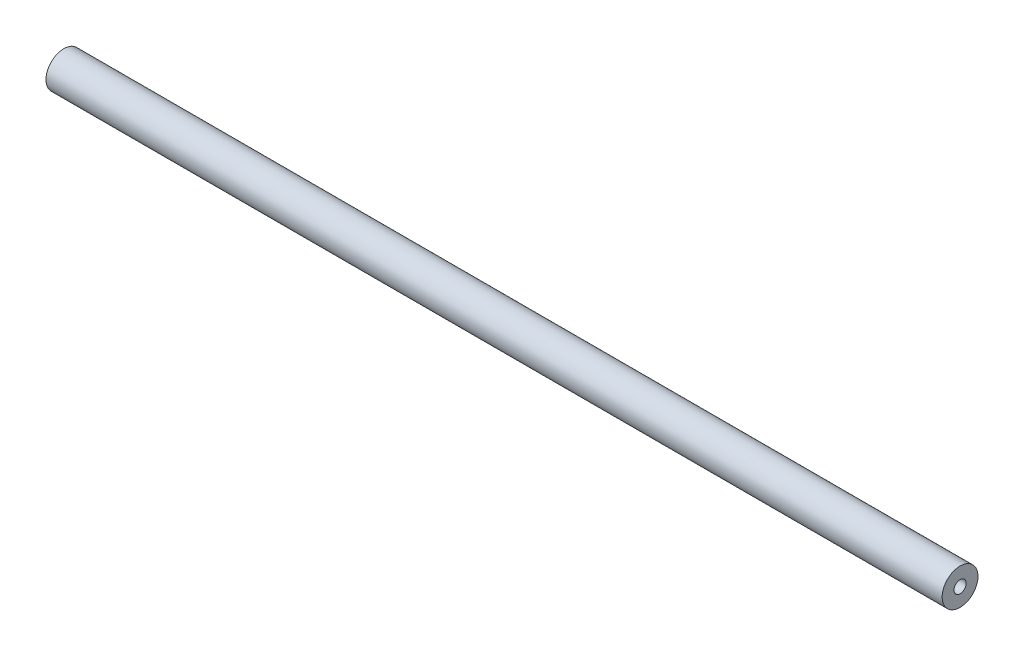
from build123d import *

# Parameters (mm, degrees)
ESQUISSE1_R                = 10
EXTRUSION1_DEPTH           = 250
TROU_TARAUD_M8X1_251_D     = 6.8
TROU_TARAUD_M8X1_251_DEPTH = 20
TROU_TARAUD_M8X1_251_TIP   = 2.042926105
TROU_TARAUD_M8X1_252_D     = 6.8
TROU_TARAUD_M8X1_252_DEPTH = 20
TROU_TARAUD_M8X1_252_TIP   = 2.042926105


with BuildPart() as part:
    # Esquisse1 → Extrusion1 (new, symmetric)
    with BuildSketch(Plane(origin=(0, 0, 0), x_dir=(0, 0, -1), z_dir=(1, 0, 0))):
        Circle(ESQUISSE1_R)
    extrude(amount=EXTRUSION1_DEPTH, both=True)

    # Trou taraud_ M8x1.251
    with Locations(Plane(origin=(250, 0, 0), x_dir=(0, 0, -1), z_dir=(1, 0, 0))):
        with Locations((0, 0)):
            Hole(TROU_TARAUD_M8X1_251_D / 2, depth=TROU_TARAUD_M8X1_251_DEPTH)
            with Locations((0, 0, -(TROU_TARAUD_M8X1_251_DEPTH + TROU_TARAUD_M8X1_251_TIP / 2))):  # 118° drill point
                Cone(0, TROU_TARAUD_M8X1_251_D / 2, TROU_TARAUD_M8X1_251_TIP, mode=Mode.SUBTRACT)

    # Trou taraud_ M8x1.252
    with Locations(Plane.ZY.offset(250)):
        with Locations((0, 0)):
            Hole(TROU_TARAUD_M8X1_252_D / 2, depth=TROU_TARAUD_M8X1_252_DEPTH)
            with Locations((0, 0, -(TROU_TARAUD_M8X1_252_DEPTH + TROU_TARAUD_M8X1_252_TIP / 2))):  # 118° drill point
                Cone(0, TROU_TARAUD_M8X1_252_D / 2, TROU_TARAUD_M8X1_252_TIP, mode=Mode.SUBTRACT)


solid = part.part
